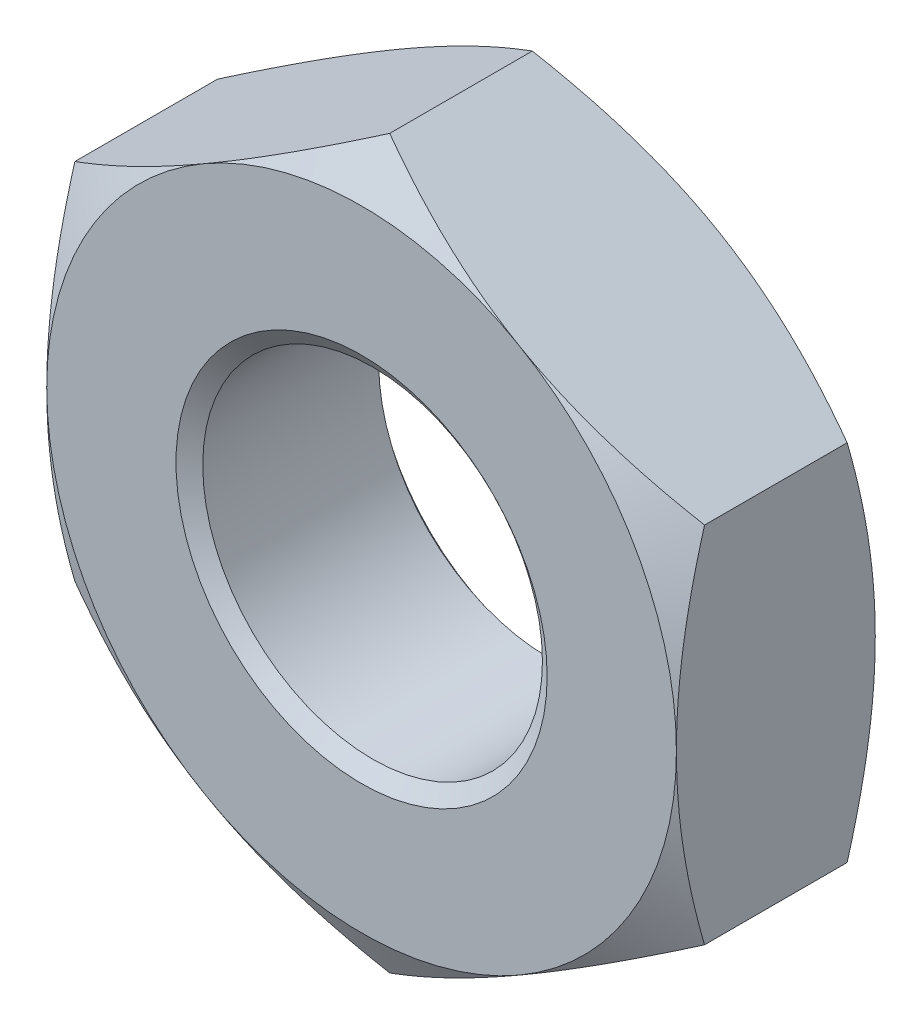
from build123d import *

# Parameters (mm, degrees)
BASENUTSKE_R  = 5.125
BASENUT_DEPTH = 6


with BuildPart() as part:
    # BaseNutSke → BaseNut (new body)
    with BuildSketch(Plane.XY):
        Polygon((9.5, 5.484827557), (9.5, -5.484827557), (0, -10.969655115), (-9.5, -5.484827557), (-9.5, 5.484827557), (0, 10.969655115), align=None)
        Circle(BASENUTSKE_R, mode=Mode.SUBTRACT)
    extrude(amount=-BASENUT_DEPTH)

    # Sketch3 → Double-Chamfer (revolve, cut)
    with BuildSketch(Plane(origin=(0, 0, 0), x_dir=(0, 0, -1), z_dir=(1, 0, 0))):
        Polygon((6, 9.5), (5.151494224, 10.969655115), (5.151494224, 20.969655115), (16, 20.969655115), (16, 9.5), align=None)
        Polygon((0.848505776, 20.969655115), (-10, 20.969655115), (-10, 9.5), (0, 9.5), (0.848505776, 10.969655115), align=None)
    revolve(axis=Axis((0, 0, 0), (0, 0, -1)), mode=Mode.SUBTRACT)

    # Sketch5 → EndChamfer (revolve, cut)
    with BuildSketch(Plane(origin=(0, 0, 0), x_dir=(0, 0, -1), z_dir=(1, 0, 0)), mode=Mode.PRIVATE) as endchamfer_sk:
        Polygon((5.9746, 5.6), (5.512463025, 4.94), (6.0254, 4.94), (6.0254, 5.6), align=None)
        Polygon((-0.0508, 5.6), (0, 5.6), (0.462136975, 4.94), (-0.0508, 4.94), align=None)
    revolve(endchamfer_sk.sketch.rotate(Axis((0, 0, -25.037505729), (0, 0, -1)), 90), axis=Axis((0, 0, -25.037505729), (0, 0, -1)), mode=Mode.SUBTRACT)


solid = part.part
